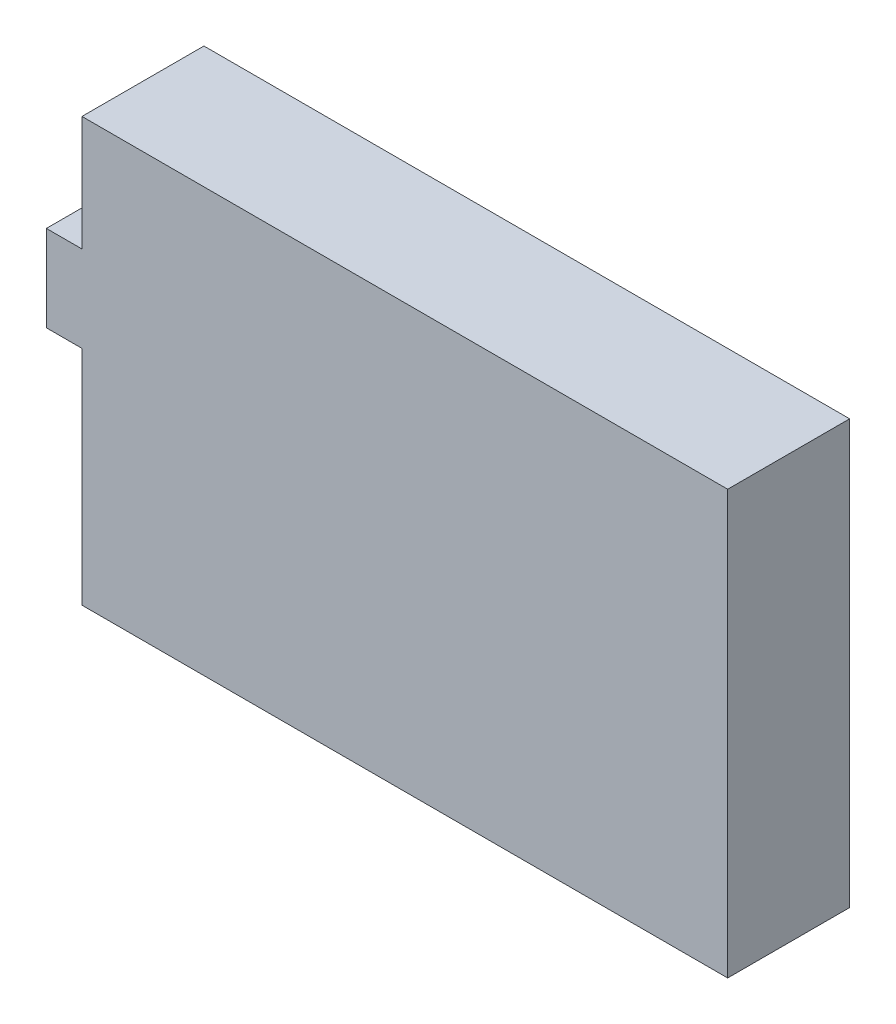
from build123d import *

# Parameters (mm, degrees)
AUFSATZ_LINEAR_AUSTRAGEN1_DEPTH = 17


with BuildPart() as part:
    # Skizze1 → Aufsatz-Linear austragen1 (new body)
    with BuildSketch(Plane.XY):
        Polygon((-45, 13.247582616), (45, 13.247582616), (45, -45.752417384), (-45, -45.752417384), (-45, -14.752417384), (-49.963009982, -14.752417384), (-49.963009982, -2.752417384), (-45, -2.752417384), align=None)
    extrude(amount=AUFSATZ_LINEAR_AUSTRAGEN1_DEPTH)


solid = part.part
